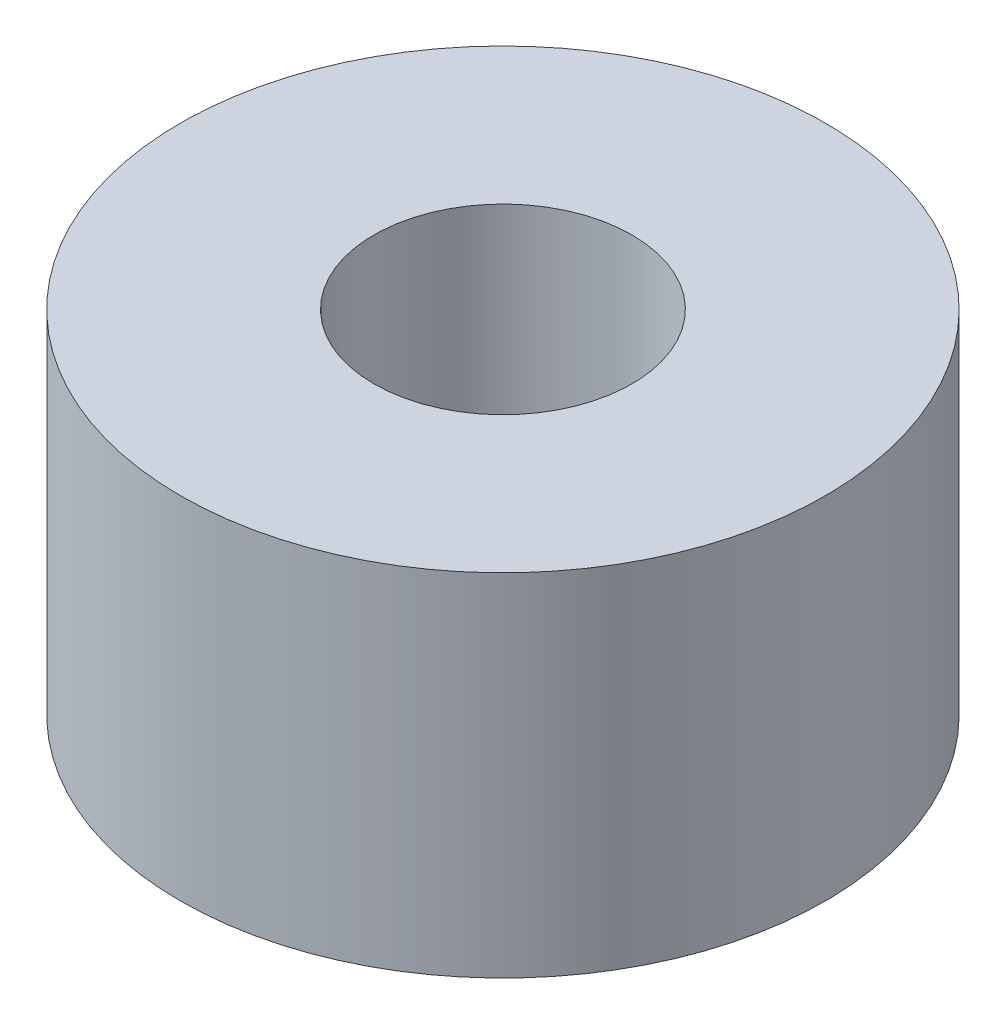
from build123d import *

# Parameters (mm, degrees)
SKETCH1_R           = 7.9375
SKETCH1_R_2         = 3.175
BOSS_EXTRUDE1_DEPTH = 8.636


with BuildPart() as part:
    # Sketch1 → Boss-Extrude1 (new body)
    with BuildSketch(Plane(origin=(0, 0, 0), x_dir=(1, 0, 0), z_dir=(0, 1, 0))):
        with Locations(Location((0, 0, 0), (0, 0, 270))):
            Circle(SKETCH1_R)
        with Locations(Location((0, 0, 0), (0, 0, 270))):
            Circle(SKETCH1_R_2, mode=Mode.SUBTRACT)
    extrude(amount=BOSS_EXTRUDE1_DEPTH)


solid = part.part
